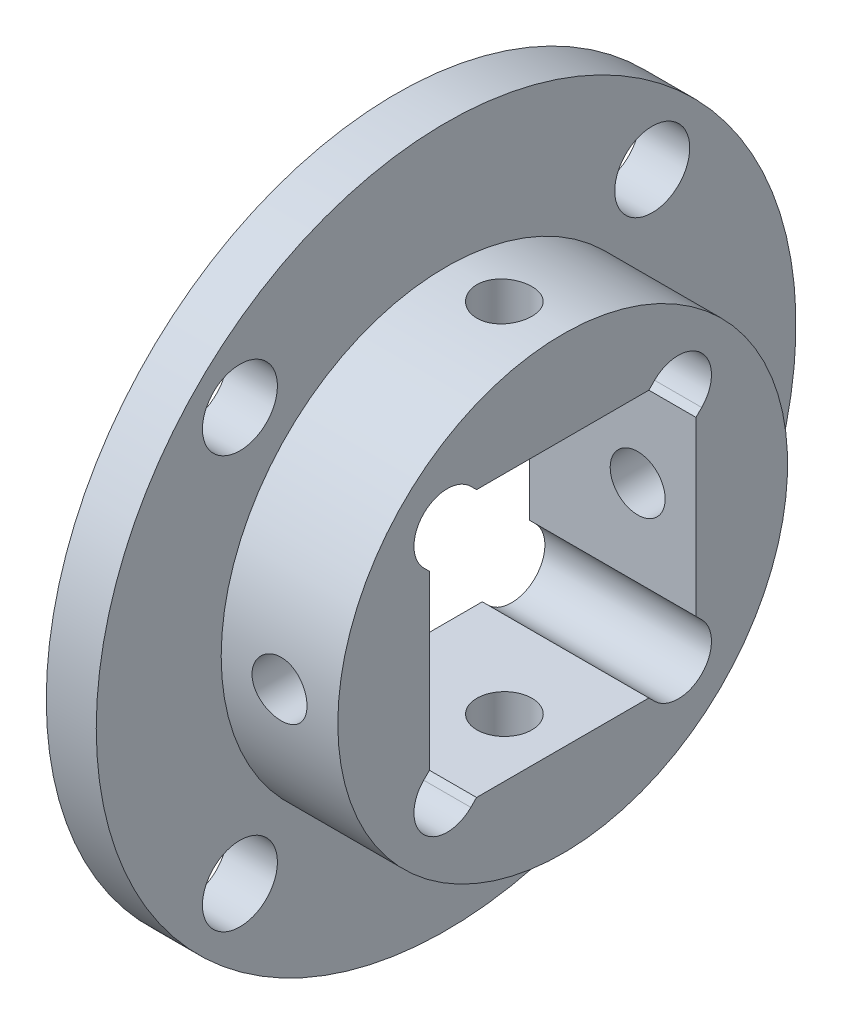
from build123d import *

# Parameters (mm, degrees)
ESQUISSE2_R                  = 2.25
ESQUISSE2_W                  = 16
ESQUISSE2_H                  = 16
ENL_V_MAT_EXTRU_1_DEPTH      = 32.336879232
TROU_TARAUD_M41_D            = 3.3
TROU_TARAUD_M41_DEPTH        = 13
R_P_TITION_CIRCULAIRE1_COUNT = 4
ENL_V_MAT_EXTRU_2_DEPTH      = 32.336879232


with BuildPart() as part:
    # Esquisse1 → R_volution1 (revolve)
    with BuildSketch(Plane.XY, mode=Mode.PRIVATE) as r_volution1_sk:
        Polygon((0, 0), (10, 0), (10, 13.5), (3, 13.5), (3, 21), (0, 21), align=None)
    revolve(r_volution1_sk.sketch.rotate(Axis((-19.097215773, 0, 0), (1, 0, 0)), 90), axis=Axis((-19.097215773, 0, 0), (1, 0, 0)))

    # Esquisse2 → Enl_v. mat.-Extru.1 (cut, through all)
    with BuildSketch(Plane(origin=(10, 0, 0), x_dir=(0, 0, -1), z_dir=(1, 0, 0))):
        with Locations((-12.374368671, 12.374368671)):
            Circle(ESQUISSE2_R)
        with Locations((12.374368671, 12.374368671)):
            Circle(ESQUISSE2_R)
        with Locations((12.374368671, -12.374368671)):
            Circle(ESQUISSE2_R)
        with Locations((-12.374368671, -12.374368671)):
            Circle(ESQUISSE2_R)
        Rectangle(ESQUISSE2_W, ESQUISSE2_H)
    extrude(amount=-ENL_V_MAT_EXTRU_1_DEPTH, mode=Mode.SUBTRACT)

    # Trou taraud_ M41
    with Locations(Plane(origin=(0, -8, 0), x_dir=(-1, 0, 0), z_dir=(0, 1, 0))):
        with Locations((-6.5, 0)):
            trou_taraud_m41 = Hole(TROU_TARAUD_M41_D / 2, depth=TROU_TARAUD_M41_DEPTH)

    # R_p_tition circulaire1: Trou taraud_ M41 ×4 about axis
    r_p_tition_circulaire1_axis = Axis((-19.097215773, 0, 0), (-1, 0, 0))
    for i in range(1, R_P_TITION_CIRCULAIRE1_COUNT):
        add(trou_taraud_m41.rotate(r_p_tition_circulaire1_axis, i * 360 / R_P_TITION_CIRCULAIRE1_COUNT), mode=Mode.SUBTRACT)

    # Esquisse7 → Enl_v. mat.-Extru.2 (cut, through all)
    with BuildSketch(Plane(origin=(10, 0, 0), x_dir=(0, 0, -1), z_dir=(1, 0, 0))):
        with BuildLine():
            Line((5.515432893, 8.343860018), (5.171572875, 8))
            Line((5.171572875, 8), (8, 5.171572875))
            Line((8, 5.171572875), (8.343860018, 5.515432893))
            ThreePointArc((8.343860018, 5.515432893), (8.343860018, 8.343860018), (5.515432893, 8.343860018))
        make_face()
        with BuildLine():
            Line((8.343860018, -5.515432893), (8, -5.171572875))
            Line((8, -5.171572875), (5.171572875, -8))
            Line((5.171572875, -8), (5.515432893, -8.343860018))
            ThreePointArc((5.515432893, -8.343860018), (8.343860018, -8.343860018), (8.343860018, -5.515432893))
        make_face()
        with BuildLine():
            Line((-5.515432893, -8.343860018), (-5.171572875, -8))
            Line((-5.171572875, -8), (-8, -5.171572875))
            Line((-8, -5.171572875), (-8.343860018, -5.515432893))
            ThreePointArc((-8.343860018, -5.515432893), (-8.343860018, -8.343860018), (-5.515432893, -8.343860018))
        make_face()
        with BuildLine():
            Line((-8.343860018, 5.515432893), (-8, 5.171572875))
            Line((-8, 5.171572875), (-5.171572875, 8))
            Line((-5.171572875, 8), (-5.515432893, 8.343860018))
            ThreePointArc((-5.515432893, 8.343860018), (-8.343860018, 8.343860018), (-8.343860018, 5.515432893))
        make_face()
    extrude(amount=-ENL_V_MAT_EXTRU_2_DEPTH, mode=Mode.SUBTRACT)


solid = part.part
